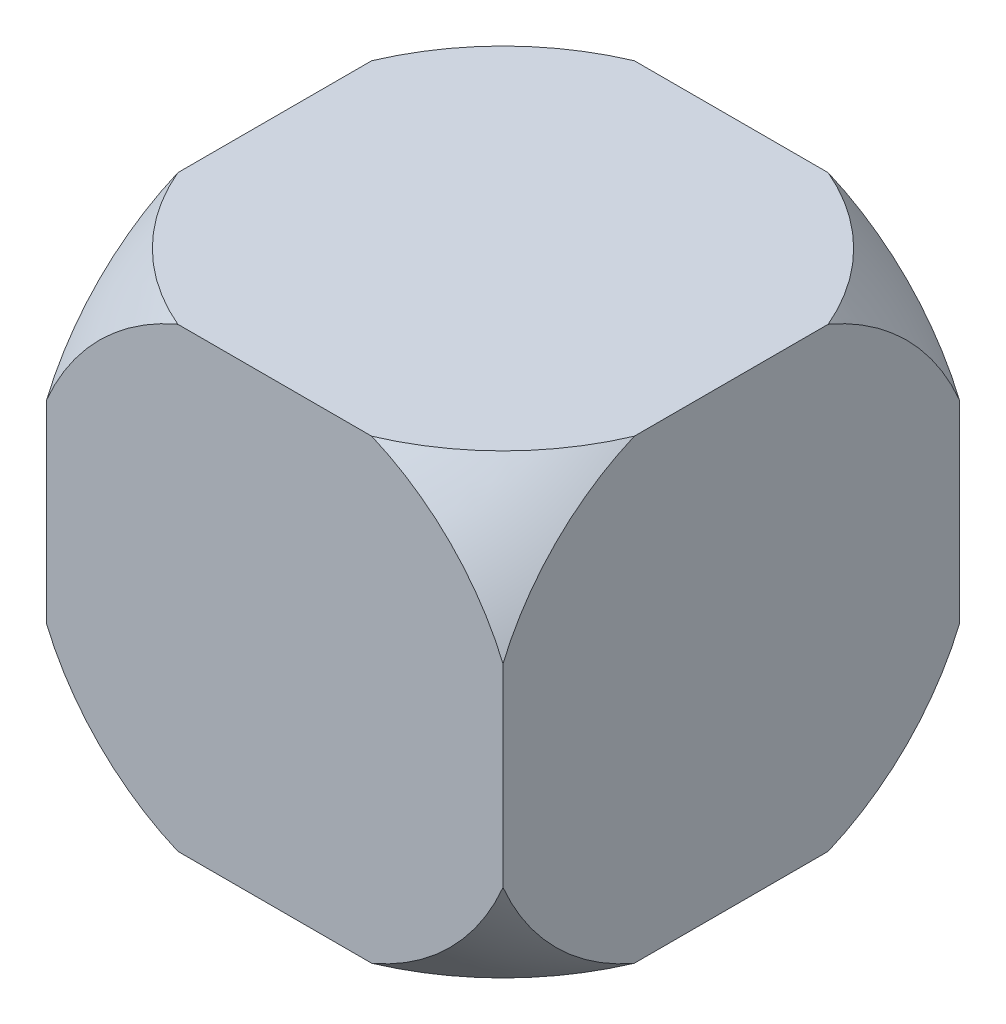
ISO-10303-21;
HEADER;
FILE_DESCRIPTION(('STEP AP214'),'2;1');
FILE_NAME('part.step','',(''),(''),'','','');
FILE_SCHEMA(('AUTOMOTIVE_DESIGN { 1 0 10303 214 1 1 1 1 }'));
ENDSEC;
DATA;
#1=APPLICATION_CONTEXT('core data for automotive mechanical design processes');
#2=APPLICATION_PROTOCOL_DEFINITION('international standard','automotive_design',2000,#1);
#3=PRODUCT_CONTEXT('',#1,'mechanical');
#4=PRODUCT('Part','Part','',(#3));
#5=PRODUCT_RELATED_PRODUCT_CATEGORY('part','',(#4));
#6=PRODUCT_DEFINITION_FORMATION('','',#4);
#7=PRODUCT_DEFINITION_CONTEXT('part definition',#1,'design');
#8=PRODUCT_DEFINITION('design','',#6,#7);
#9=PRODUCT_DEFINITION_SHAPE('','',#8);
#10=(LENGTH_UNIT() NAMED_UNIT(*) SI_UNIT(.MILLI.,.METRE.));
#11=(NAMED_UNIT(*) PLANE_ANGLE_UNIT() SI_UNIT($,.RADIAN.));
#12=(NAMED_UNIT(*) SI_UNIT($,.STERADIAN.) SOLID_ANGLE_UNIT());
#13=UNCERTAINTY_MEASURE_WITH_UNIT(LENGTH_MEASURE(1.E-05),#10,'distance_accuracy_value','');
#14=(GEOMETRIC_REPRESENTATION_CONTEXT(3) GLOBAL_UNCERTAINTY_ASSIGNED_CONTEXT((#13)) GLOBAL_UNIT_ASSIGNED_CONTEXT((#10,
#11,#12)) REPRESENTATION_CONTEXT('',''));
#15=CARTESIAN_POINT('',(0.,0.,0.));
#16=DIRECTION('',(0.,0.,1.));
#17=DIRECTION('',(1.,0.,0.));
#18=AXIS2_PLACEMENT_3D('',#15,#16,#17);
#19=CARTESIAN_POINT('',(0.,0.,25.));
#20=DIRECTION('',(0.,-1.,0.));
#21=DIRECTION('',(1.,0.,0.));
#22=AXIS2_PLACEMENT_3D('',#19,#20,#21);
#23=SPHERICAL_SURFACE('',#22,36.9147921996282);
#24=CARTESIAN_POINT('',(25.,0.,25.));
#25=DIRECTION('',(-1.,0.,0.));
#26=DIRECTION('',(0.,-1.,0.));
#27=AXIS2_PLACEMENT_3D('',#24,#25,#26);
#28=CIRCLE('',#27,27.1606679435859);
#29=CARTESIAN_POINT('',(25.,-10.6161143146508,50.));
#30=VERTEX_POINT('',#29);
#31=CARTESIAN_POINT('',(25.,-25.,35.6161143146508));
#32=VERTEX_POINT('',#31);
#33=EDGE_CURVE('E55',#30,#32,#28,.F.);
#34=ORIENTED_EDGE('',*,*,#33,.F.);
#35=CARTESIAN_POINT('',(0.,0.,50.));
#36=DIRECTION('',(0.,0.,1.));
#37=DIRECTION('',(1.,0.,0.));
#38=AXIS2_PLACEMENT_3D('',#35,#36,#37);
#39=CIRCLE('',#38,27.1606679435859);
#40=CARTESIAN_POINT('',(10.6161143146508,-25.,50.));
#41=VERTEX_POINT('',#40);
#42=EDGE_CURVE('E206',#30,#41,#39,.F.);
#43=ORIENTED_EDGE('',*,*,#42,.T.);
#44=CARTESIAN_POINT('',(0.,-25.,25.));
#45=DIRECTION('',(0.,1.,0.));
#46=DIRECTION('',(0.,0.,1.));
#47=AXIS2_PLACEMENT_3D('',#44,#45,#46);
#48=CIRCLE('',#47,27.1606679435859);
#49=EDGE_CURVE('E200',#32,#41,#48,.F.);
#50=ORIENTED_EDGE('',*,*,#49,.F.);
#51=EDGE_LOOP('',(#34,#43,#50));
#52=FACE_BOUND('',#51,.T.);
#53=ADVANCED_FACE('F31',(#52),#23,.T.);
#54=CARTESIAN_POINT('',(-25.,25.,50.));
#55=DIRECTION('',(1.,0.,0.));
#56=DIRECTION('',(0.,1.,0.));
#57=AXIS2_PLACEMENT_3D('',#54,#55,#56);
#58=PLANE('',#57);
#59=DIRECTION('',(0.,0.,-1.));
#60=VECTOR('',#59,1.);
#61=CARTESIAN_POINT('',(-25.,25.,50.));
#62=LINE('',#61,#60);
#63=CARTESIAN_POINT('',(-25.,25.,35.6161143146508));
#64=VERTEX_POINT('',#63);
#65=CARTESIAN_POINT('',(-25.,25.,14.3838856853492));
#66=VERTEX_POINT('',#65);
#67=EDGE_CURVE('E163',#64,#66,#62,.T.);
#68=ORIENTED_EDGE('',*,*,#67,.T.);
#69=CARTESIAN_POINT('',(-25.,0.,25.));
#70=DIRECTION('',(1.,0.,0.));
#71=DIRECTION('',(0.,1.,0.));
#72=AXIS2_PLACEMENT_3D('',#69,#70,#71);
#73=CIRCLE('',#72,27.1606679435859);
#74=CARTESIAN_POINT('',(-25.,10.6161143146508,0.));
#75=VERTEX_POINT('',#74);
#76=EDGE_CURVE('E193',#66,#75,#73,.F.);
#77=ORIENTED_EDGE('',*,*,#76,.T.);
#78=DIRECTION('',(0.,-1.,0.));
#79=VECTOR('',#78,1.);
#80=CARTESIAN_POINT('',(-25.,25.,0.));
#81=LINE('',#80,#79);
#82=CARTESIAN_POINT('',(-25.,-10.6161143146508,0.));
#83=VERTEX_POINT('',#82);
#84=EDGE_CURVE('E188',#75,#83,#81,.T.);
#85=ORIENTED_EDGE('',*,*,#84,.T.);
#86=CARTESIAN_POINT('',(-25.,-25.,14.3838856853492));
#87=VERTEX_POINT('',#86);
#88=EDGE_CURVE('E186',#83,#87,#73,.F.);
#89=ORIENTED_EDGE('',*,*,#88,.T.);
#90=DIRECTION('',(0.,0.,-1.));
#91=VECTOR('',#90,1.);
#92=CARTESIAN_POINT('',(-25.,-25.,50.));
#93=LINE('',#92,#91);
#94=CARTESIAN_POINT('',(-25.,-25.,35.6161143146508));
#95=VERTEX_POINT('',#94);
#96=EDGE_CURVE('E130',#95,#87,#93,.T.);
#97=ORIENTED_EDGE('',*,*,#96,.F.);
#98=CARTESIAN_POINT('',(-25.,-10.6161143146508,50.));
#99=VERTEX_POINT('',#98);
#100=EDGE_CURVE('E184',#95,#99,#73,.F.);
#101=ORIENTED_EDGE('',*,*,#100,.T.);
#102=DIRECTION('',(0.,-1.,0.));
#103=VECTOR('',#102,1.);
#104=CARTESIAN_POINT('',(-25.,25.,50.));
#105=LINE('',#104,#103);
#106=CARTESIAN_POINT('',(-25.,10.6161143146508,50.));
#107=VERTEX_POINT('',#106);
#108=EDGE_CURVE('E145',#107,#99,#105,.T.);
#109=ORIENTED_EDGE('',*,*,#108,.F.);
#110=EDGE_CURVE('E194',#107,#64,#73,.F.);
#111=ORIENTED_EDGE('',*,*,#110,.T.);
#112=EDGE_LOOP('',(#68,#77,#85,#89,#97,#101,#109,#111));
#113=FACE_BOUND('',#112,.T.);
#114=ADVANCED_FACE('F33',(#113),#58,.F.);
#115=CARTESIAN_POINT('',(-25.,-25.,50.));
#116=DIRECTION('',(0.,1.,0.));
#117=DIRECTION('',(0.,0.,1.));
#118=AXIS2_PLACEMENT_3D('',#115,#116,#117);
#119=PLANE('',#118);
#120=DIRECTION('',(1.,0.,0.));
#121=VECTOR('',#120,1.);
#122=CARTESIAN_POINT('',(-25.,-25.,50.));
#123=LINE('',#122,#121);
#124=CARTESIAN_POINT('',(-10.6161143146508,-25.,50.));
#125=VERTEX_POINT('',#124);
#126=EDGE_CURVE('E149',#125,#41,#123,.T.);
#127=ORIENTED_EDGE('',*,*,#126,.F.);
#128=EDGE_CURVE('E179',#125,#95,#48,.F.);
#129=ORIENTED_EDGE('',*,*,#128,.T.);
#130=ORIENTED_EDGE('',*,*,#96,.T.);
#131=CARTESIAN_POINT('',(-10.6161143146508,-25.,0.));
#132=VERTEX_POINT('',#131);
#133=EDGE_CURVE('E177',#87,#132,#48,.F.);
#134=ORIENTED_EDGE('',*,*,#133,.T.);
#135=DIRECTION('',(1.,0.,0.));
#136=VECTOR('',#135,1.);
#137=CARTESIAN_POINT('',(-25.,-25.,0.));
#138=LINE('',#137,#136);
#139=CARTESIAN_POINT('',(10.6161143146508,-25.,0.));
#140=VERTEX_POINT('',#139);
#141=EDGE_CURVE('E151',#132,#140,#138,.T.);
#142=ORIENTED_EDGE('',*,*,#141,.T.);
#143=CARTESIAN_POINT('',(25.,-25.,14.3838856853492));
#144=VERTEX_POINT('',#143);
#145=EDGE_CURVE('E196',#140,#144,#48,.F.);
#146=ORIENTED_EDGE('',*,*,#145,.T.);
#147=DIRECTION('',(0.,0.,-1.));
#148=VECTOR('',#147,1.);
#149=CARTESIAN_POINT('',(25.,-25.,50.));
#150=LINE('',#149,#148);
#151=EDGE_CURVE('E167',#32,#144,#150,.T.);
#152=ORIENTED_EDGE('',*,*,#151,.F.);
#153=ORIENTED_EDGE('',*,*,#49,.T.);
#154=EDGE_LOOP('',(#127,#129,#130,#134,#142,#146,#152,#153));
#155=FACE_BOUND('',#154,.T.);
#156=ADVANCED_FACE('F175',(#155),#119,.F.);
#157=CARTESIAN_POINT('',(25.,25.,50.));
#158=DIRECTION('',(-1.,0.,0.));
#159=DIRECTION('',(0.,-1.,0.));
#160=AXIS2_PLACEMENT_3D('',#157,#158,#159);
#161=PLANE('',#160);
#162=ORIENTED_EDGE('',*,*,#151,.T.);
#163=CARTESIAN_POINT('',(25.,-10.6161143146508,0.));
#164=VERTEX_POINT('',#163);
#165=EDGE_CURVE('E191',#144,#164,#28,.F.);
#166=ORIENTED_EDGE('',*,*,#165,.T.);
#167=DIRECTION('',(0.,1.,0.));
#168=VECTOR('',#167,1.);
#169=CARTESIAN_POINT('',(25.,25.,0.));
#170=LINE('',#169,#168);
#171=CARTESIAN_POINT('',(25.,10.6161143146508,0.));
#172=VERTEX_POINT('',#171);
#173=EDGE_CURVE('E146',#164,#172,#170,.T.);
#174=ORIENTED_EDGE('',*,*,#173,.T.);
#175=CARTESIAN_POINT('',(25.,25.,14.3838856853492));
#176=VERTEX_POINT('',#175);
#177=EDGE_CURVE('E124',#172,#176,#28,.F.);
#178=ORIENTED_EDGE('',*,*,#177,.T.);
#179=DIRECTION('',(0.,0.,-1.));
#180=VECTOR('',#179,1.);
#181=CARTESIAN_POINT('',(25.,25.,50.));
#182=LINE('',#181,#180);
#183=CARTESIAN_POINT('',(25.,25.,35.6161143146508));
#184=VERTEX_POINT('',#183);
#185=EDGE_CURVE('E138',#184,#176,#182,.T.);
#186=ORIENTED_EDGE('',*,*,#185,.F.);
#187=CARTESIAN_POINT('',(25.,10.6161143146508,50.));
#188=VERTEX_POINT('',#187);
#189=EDGE_CURVE('E198',#184,#188,#28,.F.);
#190=ORIENTED_EDGE('',*,*,#189,.T.);
#191=DIRECTION('',(0.,1.,0.));
#192=VECTOR('',#191,1.);
#193=CARTESIAN_POINT('',(25.,25.,50.));
#194=LINE('',#193,#192);
#195=EDGE_CURVE('E157',#30,#188,#194,.T.);
#196=ORIENTED_EDGE('',*,*,#195,.F.);
#197=ORIENTED_EDGE('',*,*,#33,.T.);
#198=EDGE_LOOP('',(#162,#166,#174,#178,#186,#190,#196,#197));
#199=FACE_BOUND('',#198,.T.);
#200=ADVANCED_FACE('F222',(#199),#161,.F.);
#201=CARTESIAN_POINT('',(-25.,25.,50.));
#202=DIRECTION('',(0.,-1.,0.));
#203=DIRECTION('',(0.,0.,-1.));
#204=AXIS2_PLACEMENT_3D('',#201,#202,#203);
#205=PLANE('',#204);
#206=DIRECTION('',(-1.,0.,0.));
#207=VECTOR('',#206,1.);
#208=CARTESIAN_POINT('',(-25.,25.,0.));
#209=LINE('',#208,#207);
#210=CARTESIAN_POINT('',(10.6161143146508,25.,0.));
#211=VERTEX_POINT('',#210);
#212=CARTESIAN_POINT('',(-10.6161143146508,25.,0.));
#213=VERTEX_POINT('',#212);
#214=EDGE_CURVE('E136',#211,#213,#209,.T.);
#215=ORIENTED_EDGE('',*,*,#214,.T.);
#216=CARTESIAN_POINT('',(0.,25.,25.));
#217=DIRECTION('',(0.,-1.,0.));
#218=DIRECTION('',(0.,0.,-1.));
#219=AXIS2_PLACEMENT_3D('',#216,#217,#218);
#220=CIRCLE('',#219,27.1606679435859);
#221=EDGE_CURVE('E141',#213,#66,#220,.F.);
#222=ORIENTED_EDGE('',*,*,#221,.T.);
#223=ORIENTED_EDGE('',*,*,#67,.F.);
#224=CARTESIAN_POINT('',(-10.6161143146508,25.,50.));
#225=VERTEX_POINT('',#224);
#226=EDGE_CURVE('E140',#64,#225,#220,.F.);
#227=ORIENTED_EDGE('',*,*,#226,.T.);
#228=DIRECTION('',(-1.,0.,0.));
#229=VECTOR('',#228,1.);
#230=CARTESIAN_POINT('',(-25.,25.,50.));
#231=LINE('',#230,#229);
#232=CARTESIAN_POINT('',(10.6161143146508,25.,50.));
#233=VERTEX_POINT('',#232);
#234=EDGE_CURVE('E160',#233,#225,#231,.T.);
#235=ORIENTED_EDGE('',*,*,#234,.F.);
#236=EDGE_CURVE('E47',#233,#184,#220,.F.);
#237=ORIENTED_EDGE('',*,*,#236,.T.);
#238=ORIENTED_EDGE('',*,*,#185,.T.);
#239=EDGE_CURVE('E122',#176,#211,#220,.F.);
#240=ORIENTED_EDGE('',*,*,#239,.T.);
#241=EDGE_LOOP('',(#215,#222,#223,#227,#235,#237,#238,#240));
#242=FACE_BOUND('',#241,.T.);
#243=ADVANCED_FACE('F134',(#242),#205,.F.);
#244=CARTESIAN_POINT('',(-25.,-25.,50.));
#245=DIRECTION('',(0.,0.,1.));
#246=DIRECTION('',(1.,0.,0.));
#247=AXIS2_PLACEMENT_3D('',#244,#245,#246);
#248=PLANE('',#247);
#249=ORIENTED_EDGE('',*,*,#42,.F.);
#250=ORIENTED_EDGE('',*,*,#195,.T.);
#251=EDGE_CURVE('E208',#233,#188,#39,.F.);
#252=ORIENTED_EDGE('',*,*,#251,.F.);
#253=ORIENTED_EDGE('',*,*,#234,.T.);
#254=EDGE_CURVE('E205',#107,#225,#39,.F.);
#255=ORIENTED_EDGE('',*,*,#254,.F.);
#256=ORIENTED_EDGE('',*,*,#108,.T.);
#257=EDGE_CURVE('E202',#125,#99,#39,.F.);
#258=ORIENTED_EDGE('',*,*,#257,.F.);
#259=ORIENTED_EDGE('',*,*,#126,.T.);
#260=EDGE_LOOP('',(#249,#250,#252,#253,#255,#256,#258,#259));
#261=FACE_BOUND('',#260,.T.);
#262=ADVANCED_FACE('F221',(#261),#248,.T.);
#263=CARTESIAN_POINT('',(-25.,-25.,0.));
#264=DIRECTION('',(0.,0.,1.));
#265=DIRECTION('',(1.,0.,0.));
#266=AXIS2_PLACEMENT_3D('',#263,#264,#265);
#267=PLANE('',#266);
#268=ORIENTED_EDGE('',*,*,#173,.F.);
#269=CARTESIAN_POINT('',(0.,0.,0.));
#270=DIRECTION('',(0.,0.,1.));
#271=DIRECTION('',(1.,0.,0.));
#272=AXIS2_PLACEMENT_3D('',#269,#270,#271);
#273=CIRCLE('',#272,27.1606679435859);
#274=EDGE_CURVE('E11',#164,#140,#273,.F.);
#275=ORIENTED_EDGE('',*,*,#274,.T.);
#276=ORIENTED_EDGE('',*,*,#141,.F.);
#277=EDGE_CURVE('E40',#132,#83,#273,.F.);
#278=ORIENTED_EDGE('',*,*,#277,.T.);
#279=ORIENTED_EDGE('',*,*,#84,.F.);
#280=EDGE_CURVE('E129',#75,#213,#273,.F.);
#281=ORIENTED_EDGE('',*,*,#280,.T.);
#282=ORIENTED_EDGE('',*,*,#214,.F.);
#283=EDGE_CURVE('E35',#211,#172,#273,.F.);
#284=ORIENTED_EDGE('',*,*,#283,.T.);
#285=EDGE_LOOP('',(#268,#275,#276,#278,#279,#281,#282,#284));
#286=FACE_BOUND('',#285,.T.);
#287=ADVANCED_FACE('F143',(#286),#267,.F.);
#288=ORIENTED_EDGE('',*,*,#283,.F.);
#289=ORIENTED_EDGE('',*,*,#239,.F.);
#290=ORIENTED_EDGE('',*,*,#177,.F.);
#291=EDGE_LOOP('',(#288,#289,#290));
#292=FACE_BOUND('',#291,.T.);
#293=ADVANCED_FACE('F121',(#292),#23,.T.);
#294=ORIENTED_EDGE('',*,*,#221,.F.);
#295=ORIENTED_EDGE('',*,*,#280,.F.);
#296=ORIENTED_EDGE('',*,*,#76,.F.);
#297=EDGE_LOOP('',(#294,#295,#296));
#298=FACE_BOUND('',#297,.T.);
#299=ADVANCED_FACE('F242',(#298),#23,.T.);
#300=ORIENTED_EDGE('',*,*,#277,.F.);
#301=ORIENTED_EDGE('',*,*,#133,.F.);
#302=ORIENTED_EDGE('',*,*,#88,.F.);
#303=EDGE_LOOP('',(#300,#301,#302));
#304=FACE_BOUND('',#303,.T.);
#305=ADVANCED_FACE('F232',(#304),#23,.T.);
#306=ORIENTED_EDGE('',*,*,#274,.F.);
#307=ORIENTED_EDGE('',*,*,#165,.F.);
#308=ORIENTED_EDGE('',*,*,#145,.F.);
#309=EDGE_LOOP('',(#306,#307,#308));
#310=FACE_BOUND('',#309,.T.);
#311=ADVANCED_FACE('F225',(#310),#23,.T.);
#312=ORIENTED_EDGE('',*,*,#236,.F.);
#313=ORIENTED_EDGE('',*,*,#251,.T.);
#314=ORIENTED_EDGE('',*,*,#189,.F.);
#315=EDGE_LOOP('',(#312,#313,#314));
#316=FACE_BOUND('',#315,.T.);
#317=ADVANCED_FACE('F223',(#316),#23,.T.);
#318=ORIENTED_EDGE('',*,*,#254,.T.);
#319=ORIENTED_EDGE('',*,*,#226,.F.);
#320=ORIENTED_EDGE('',*,*,#110,.F.);
#321=EDGE_LOOP('',(#318,#319,#320));
#322=FACE_BOUND('',#321,.T.);
#323=ADVANCED_FACE('F219',(#322),#23,.T.);
#324=ORIENTED_EDGE('',*,*,#128,.F.);
#325=ORIENTED_EDGE('',*,*,#257,.T.);
#326=ORIENTED_EDGE('',*,*,#100,.F.);
#327=EDGE_LOOP('',(#324,#325,#326));
#328=FACE_BOUND('',#327,.T.);
#329=ADVANCED_FACE('F231',(#328),#23,.T.);
#330=CLOSED_SHELL('',(#53,#114,#156,#200,#243,#262,#287,#293,#299,#305,#311,#317,#323,#329));
#331=MANIFOLD_SOLID_BREP('B2',#330);
#332=ADVANCED_BREP_SHAPE_REPRESENTATION('',(#18,#331),#14);
#333=SHAPE_DEFINITION_REPRESENTATION(#9,#332);
ENDSEC;
END-ISO-10303-21;
